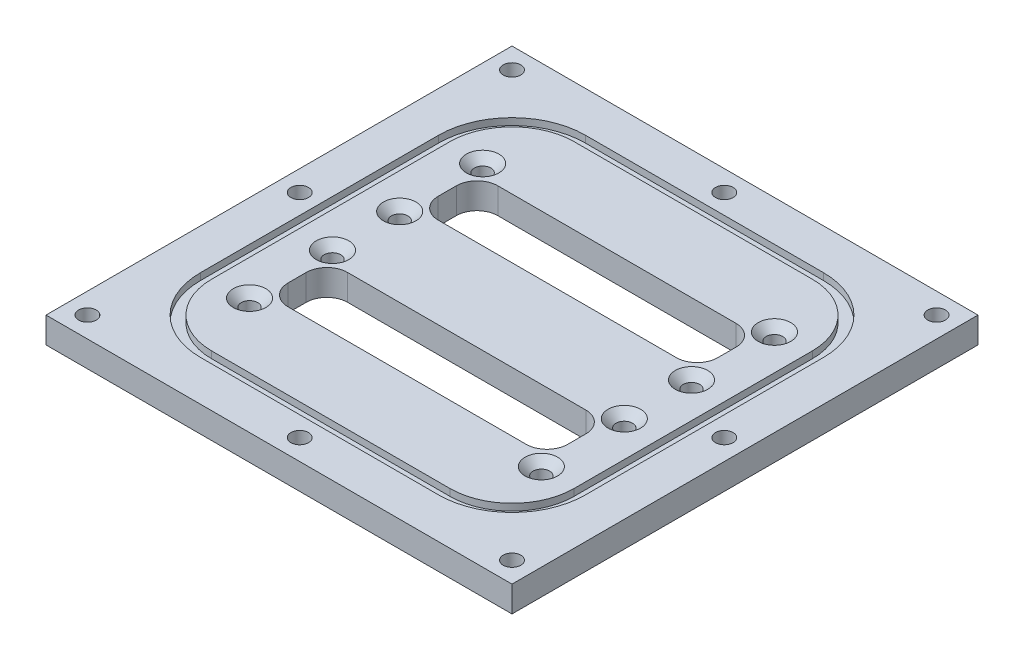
from build123d import *

# Parameters (mm, degrees)
SKETCH1_W                                       = 90
SKETCH1_H                                       = 90
BOSS_EXTRUDE1_DEPTH                             = 5
SKETCH2_W                                       = 54
SKETCH2_H                                       = 11.5
CUT_EXTRUDE1_DEPTH                              = 64.835726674
FILLET1_R                                       = 4
CSK_FOR_M3_FLAT_HEAD_MACHINE_SCREW1_D           = 3.2
CSK_FOR_M3_FLAT_HEAD_MACHINE_SCREW1_CSINK_D     = 6.3
CSK_FOR_M3_FLAT_HEAD_MACHINE_SCREW1_CSINK_ANGLE = 90
F_3_4_3_4_DIAMETER_HOLE1_D                      = 3.4
CUT_EXTRUDE2_DEPTH                              = 1.3208


with BuildPart() as part:
    # Sketch1 → Boss-Extrude1 (new body)
    with BuildSketch(Plane(origin=(0, 0, 0), x_dir=(1, 0, 0), z_dir=(0, 1, 0))):
        Rectangle(SKETCH1_W, SKETCH1_H)
    extrude(amount=BOSS_EXTRUDE1_DEPTH)

    # Sketch2 → Cut-Extrude1 (cut, through all)
    with BuildSketch(Plane(origin=(0, 5, 0), x_dir=(1, 0, 0), z_dir=(0, 1, 0))):
        with Locations((0, 14.5)):
            Rectangle(SKETCH2_W, SKETCH2_H)
        with Locations((0, -14.5)):
            Rectangle(SKETCH2_W, SKETCH2_H)
    extrude(amount=-CUT_EXTRUDE1_DEPTH, mode=Mode.SUBTRACT)

    # Fillet1
    fillet1_edges = [part.edges().sort_by_distance(p)[0] for p in [
        (27, 2.5, -20.25),
        (27, 2.5, -8.75),
        (-27, 2.5, -8.75),
        (-27, 2.5, -20.25),
        (27, 2.5, 8.75),
        (27, 2.5, 20.25),
        (-27, 2.5, 20.25),
        (-27, 2.5, 8.75),
    ]]
    fillet(fillet1_edges, radius=FILLET1_R)

    # CSK for M3 Flat Head Machine Screw1 (through all)
    with Locations(Plane(origin=(0, 5, 0), x_dir=(-1, 0, 0), z_dir=(0, 1, 0))):
        with Locations((28.18, -6.49), (28.18, -22.51), (-28.18, -22.51), (-28.18, -6.49), (28.18, 6.49), (-28.18, 6.49), (-28.18, 22.51), (28.18, 22.51)):
            CounterSinkHole(CSK_FOR_M3_FLAT_HEAD_MACHINE_SCREW1_D / 2, CSK_FOR_M3_FLAT_HEAD_MACHINE_SCREW1_CSINK_D / 2, counter_sink_angle=CSK_FOR_M3_FLAT_HEAD_MACHINE_SCREW1_CSINK_ANGLE)

    # 3.4 _3.4_ Diameter Hole1 (through all)
    with Locations(Plane.XZ):
        with Locations((-41, 41), (0, 41), (41, 41), (41, 0), (41, -41), (0, -41), (-41, -41), (-41, 0)):
            Hole(F_3_4_3_4_DIAMETER_HOLE1_D / 2)

    # Sketch9 → Cut-Extrude2 (cut)
    with BuildSketch(Plane(origin=(0, 5, 0), x_dir=(1, 0, 0), z_dir=(0, 1, 0))):
        with BuildLine():
            Line((23, -37.1717), (-23, -37.1717))
            ThreePointArc((-23, -37.1717), (-33.020905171, -33.020905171), (-37.1717, -23))
            Line((-37.1717, -23), (-37.1717, 23))
            ThreePointArc((-37.1717, 23), (-33.020905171, 33.020905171), (-23, 37.1717))
            Line((-23, 37.1717), (23, 37.1717))
            ThreePointArc((23, 37.1717), (33.020905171, 33.020905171), (37.1717, 23))
            Line((37.1717, 23), (37.1717, -23))
            ThreePointArc((37.1717, -23), (33.020905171, -33.020905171), (23, -37.1717))
        make_face()
        with BuildLine():
            Line((23, -35), (-23, -35))
            ThreePointArc((-23, -35), (-31.485281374, -31.485281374), (-35, -23))
            Line((-35, -23), (-35, 23))
            ThreePointArc((-35, 23), (-31.485281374, 31.485281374), (-23, 35))
            Line((-23, 35), (23, 35))
            ThreePointArc((23, 35), (31.485281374, 31.485281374), (35, 23))
            Line((35, 23), (35, -23))
            ThreePointArc((35, -23), (31.485281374, -31.485281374), (23, -35))
        make_face(mode=Mode.SUBTRACT)
    extrude(amount=-CUT_EXTRUDE2_DEPTH, mode=Mode.SUBTRACT)


solid = part.part
